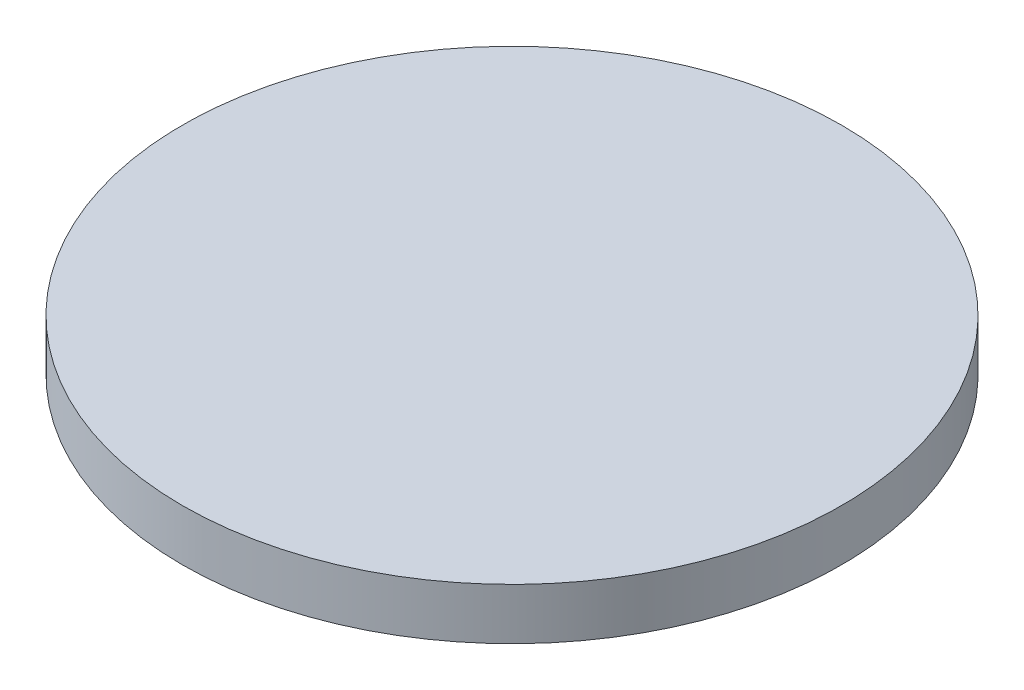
from build123d import *

# Parameters (mm, degrees)
SKETCH1_R           = 19.25
BOSS_EXTRUDE1_DEPTH = 3


with BuildPart() as part:
    # Sketch1 → Boss-Extrude1 (new body)
    with BuildSketch(Plane(origin=(0, 0, 0), x_dir=(1, 0, 0), z_dir=(0, 1, 0))):
        with Locations(Location((0, 0, 0), (0, 0, 270))):
            Circle(SKETCH1_R)
    extrude(amount=BOSS_EXTRUDE1_DEPTH)


solid = part.part
